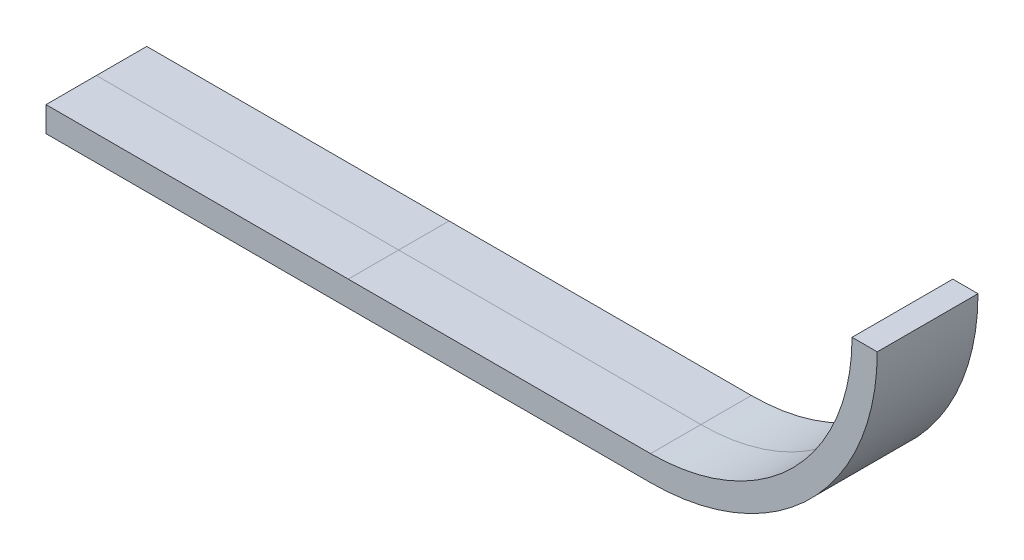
from build123d import *

# Parameters (mm, degrees)
EXTRUDE1_DEPTH = 12.7


with BuildPart() as part:
    # Sketch1 → Extrude1 (new body)
    with BuildSketch(Plane.XY):
        with BuildLine():
            Line((-38.1, 3.175), (-38.1, 0))
            Line((-38.1, 0), (38.1, 0))
            ThreePointArc((38.1, 0), (58.305576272, 8.369423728), (66.675, 28.575))
            Line((66.675, 28.575), (63.5, 28.575))
            ThreePointArc((63.5, 28.575), (56.060512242, 10.614487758), (38.1, 3.175))
            Line((38.1, 3.175), (-38.1, 3.175))
        make_face()
    extrude(amount=EXTRUDE1_DEPTH)


solid = part.part
